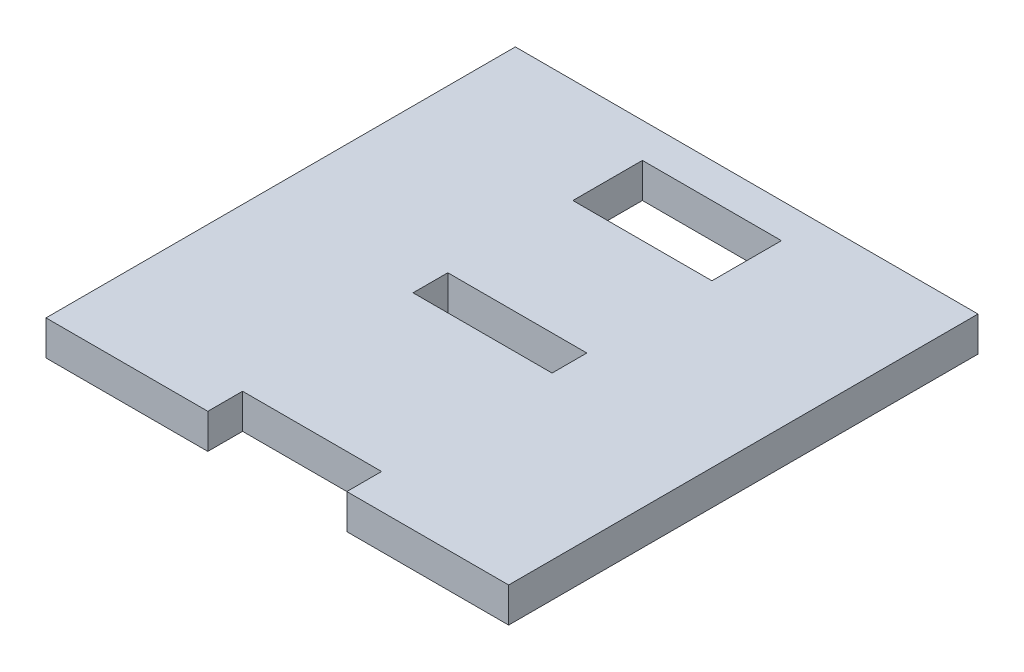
from build123d import *

# Parameters (mm, degrees)
SKETCH1_W           = 20
SKETCH1_H           = 10
SKETCH1_H_2         = 5
BOSS_EXTRUDE1_DEPTH = 5


with BuildPart() as part:
    # Sketch1 → Boss-Extrude1 (new body)
    with BuildSketch(Plane(origin=(0, 0, 0), x_dir=(1, 0, 0), z_dir=(0, 1, 0))):
        Polygon((0, 114.8613654), (66.5607, 114.8613654), (66.5607, 47.338), (43.28035, 47.338), (43.28035, 52.338), (23.28035, 52.338), (23.28035, 47.338), (0, 47.338), align=None)
        with Locations((33.28035, 104.8613654)):
            Rectangle(SKETCH1_W, SKETCH1_H, mode=Mode.SUBTRACT)
        with Locations((33.28035, 79.36424)):
            Rectangle(SKETCH1_W, SKETCH1_H_2, mode=Mode.SUBTRACT)
    extrude(amount=BOSS_EXTRUDE1_DEPTH)


solid = part.part
